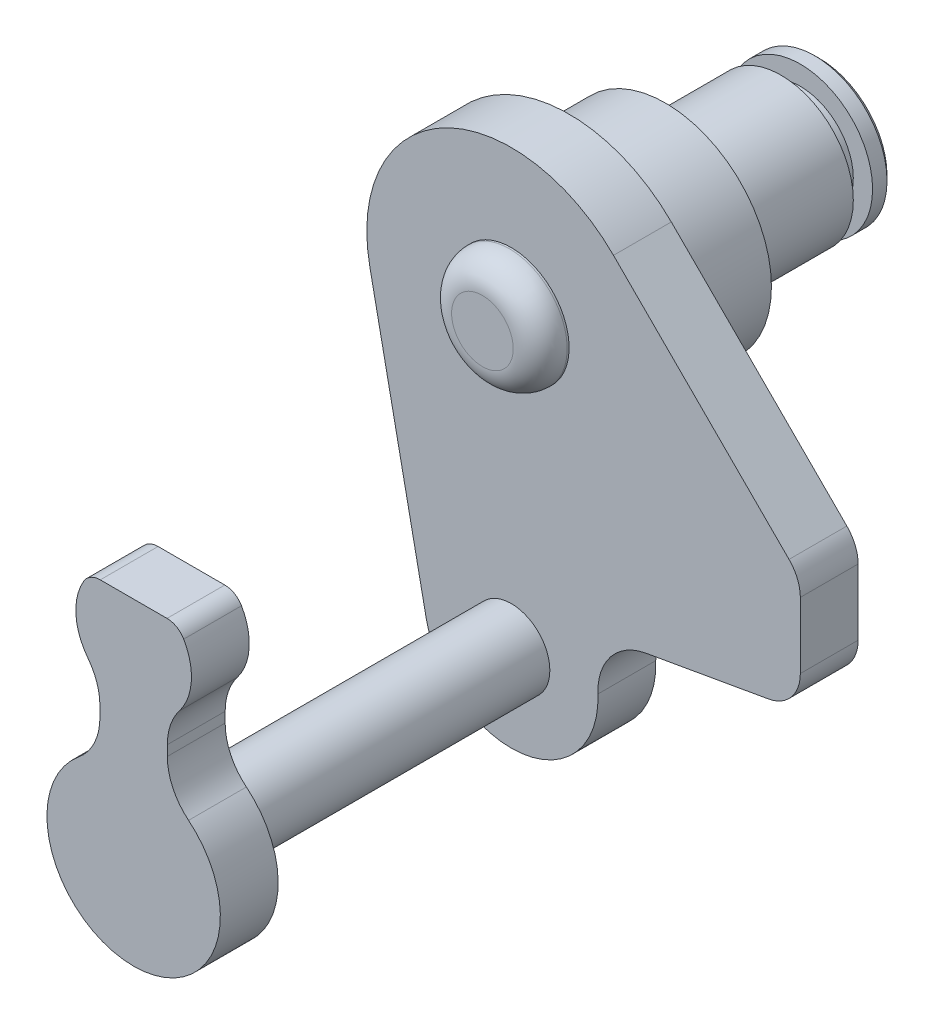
from build123d import *

# Parameters (mm, degrees)
EXTRUSION1_DEPTH = 3
CONG_1_R         = 1
CONG_3_R         = 3
ESQUISSE2_R      = 2
EXTRUSION2_DEPTH = 16.6
EXTRUSION3_START = 3
EXTRUSION3_DEPTH = 3
CONG_4_R         = 3
CONG_5_R         = 2
EXTRUSION4_DEPTH = 0.5
CONG_6_R         = 1.4
CHANFREIN1_SIZE  = 0.25


with BuildPart() as part:
    # Esquisse1 → Extrusion1 (new body)
    with BuildSketch(Plane.XY):
        with BuildLine():
            Line((-2.236067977, 12), (2.236067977, 12))
            ThreePointArc((2.236067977, 12), (2.982156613, 9.67328616), (1.75, 7.563301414))
            Line((1.75, 7.563301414), (1.75, 4.145780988))
            ThreePointArc((1.75, 4.145780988), (0, -4.5), (-1.75, 4.145780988))
            Line((-1.75, 4.145780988), (-1.75, 7.563301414))
            ThreePointArc((-1.75, 7.563301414), (-2.982156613, 9.67328616), (-2.236067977, 12))
        make_face()
    extrude(amount=EXTRUSION1_DEPTH)

    # Cong_1
    cong_1_edges = [part.edges().sort_by_distance(p)[0] for p in [
        (-2.236067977, 12, 1.5),
        (2.236067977, 12, 1.5),
    ]]
    fillet(cong_1_edges, radius=CONG_1_R)

    # Cong_3
    cong_3_edges = [part.edges().sort_by_distance(p)[0] for p in [
        (-1.75, 4.145780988, 1.5),
        (-1.75, 7.563301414, 1.5),
        (1.75, 7.563301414, 1.5),
        (1.75, 4.145780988, 1.5),
    ]]
    fillet(cong_3_edges, radius=CONG_3_R)

    # Esquisse2 → Extrusion2 (add)
    with BuildSketch(Plane(origin=(0, 0, 0), x_dir=(-1, 0, 0), z_dir=(0, 0, -1))):
        with Locations(Location((0, 0, 0), (0, 0, 180))):
            Circle(ESQUISSE2_R)
    extrude(amount=EXTRUSION2_DEPTH)

    # Esquisse3 → Extrusion3 (add)
    with BuildSketch(Plane(origin=(0, 0, -16.6), x_dir=(-1, 0, 0), z_dir=(0, 0, -1)).offset(EXTRUSION3_START)):
        with BuildLine():
            Line((-15, 4.675757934), (-3.622590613, 2.669613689))
            ThreePointArc((-3.622590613, 2.669613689), (-1.82761524, -4.112155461), (4.409081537, -0.9))
            Line((4.409081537, -0.9), (7.348469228, 13.5))
            ThreePointArc((7.348469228, 13.5), (3.552028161, 21.60553525), (-5.303300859, 20.303300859))
            Line((-5.303300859, 20.303300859), (-15, 10.606601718))
            Line((-15, 10.606601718), (-15, 4.675757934))
        make_face()
    extrude(amount=-EXTRUSION3_DEPTH)

    # Cong_4
    cong_4_edges = [part.edges().sort_by_distance(p)[0] for p in [
        (3.622590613, 2.669613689, -18.1),
    ]]
    fillet(cong_4_edges, radius=CONG_4_R)

    # Cong_5
    cong_5_edges = [part.edges().sort_by_distance(p)[0] for p in [
        (15, 10.606601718, -18.1),
        (15, 4.675757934, -18.1),
    ]]
    fillet(cong_5_edges, radius=CONG_5_R)

    # Esquisse4 → Extrusion4 (add)
    with BuildSketch(Plane(origin=(0, 0, -19.6), x_dir=(-1, 0, 0), z_dir=(0, 0, -1))):
        with BuildLine():
            Line((-1.658312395, 2.5), (1.658312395, 2.5))
            ThreePointArc((1.658312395, 2.5), (3, 0), (1.658312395, -2.5))
            Line((1.658312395, -2.5), (-1.658312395, -2.5))
            ThreePointArc((-1.658312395, -2.5), (-3, 0), (-1.658312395, 2.5))
        make_face()
    extrude(amount=EXTRUSION4_DEPTH)

    # Esquisse6 → R_volution1 (revolve)
    with BuildSketch(Plane(origin=(0, 0, 0), x_dir=(0, 0, -1), z_dir=(1, 0, 0)), mode=Mode.PRIVATE) as r_volution1_sk:
        Polygon((19.6, 20.5), (24.6, 20.5), (24.6, 18.75), (30.6, 18.75), (30.6, 17.75), (31.6, 17.75), (31.6, 18.75), (32.6, 18.75), (32.6, 15), (15.1, 15), (15.1, 18), (19.6, 18), align=None)
    revolve(r_volution1_sk.sketch.rotate(Axis((0, 15, -19.6), (0, 0, -1)), 90), axis=Axis((0, 15, -19.6), (0, 0, -1)))

    # Cong_6
    cong_6_edges = [part.edges().sort_by_distance(p)[0] for p in [
        (-3, 15, -15.1),
    ]]
    fillet(cong_6_edges, radius=CONG_6_R)

    # Chanfrein1
    chanfrein1_edges = [part.edges().sort_by_distance(p)[0] for p in [
        (-3.75, 15, -32.6),
    ]]
    chamfer(chanfrein1_edges, length=CHANFREIN1_SIZE)


solid = part.part
